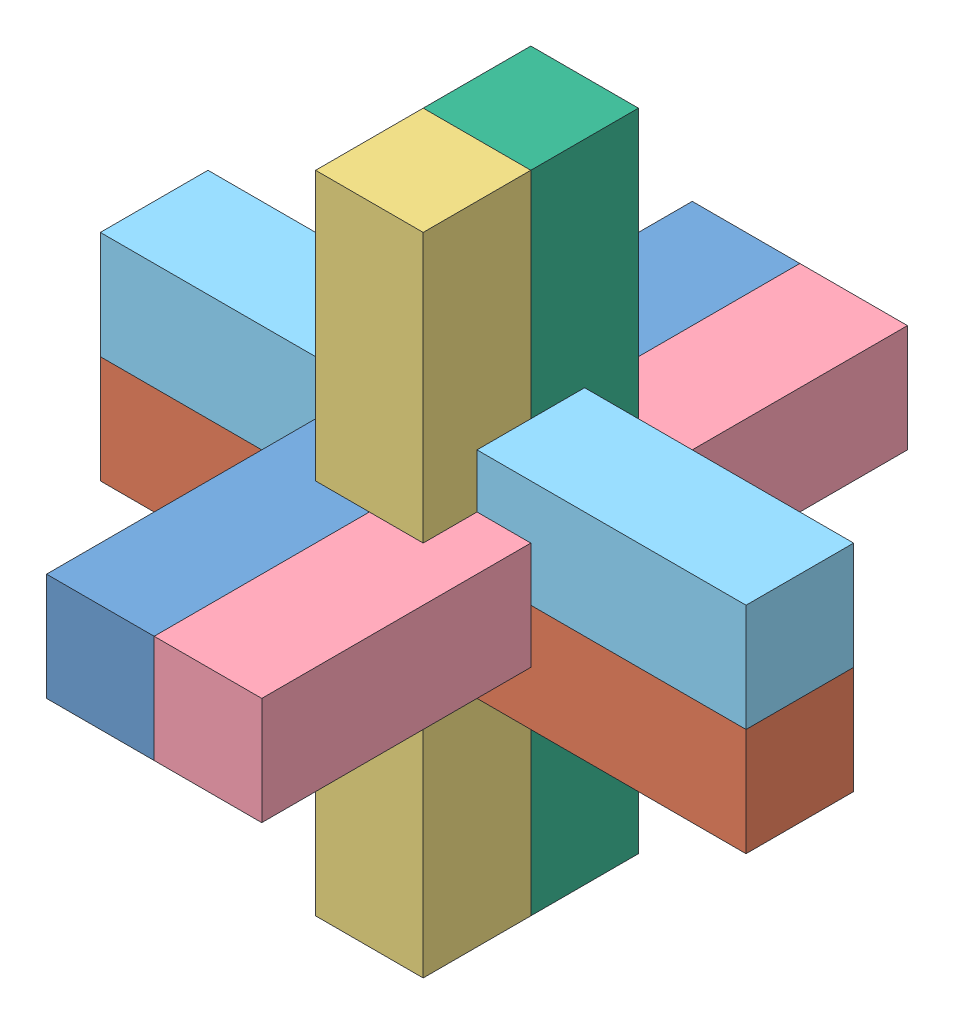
SolidWorks assembly Assem1.SLDASM, configuration Default (file format 4100). Lengths in mm.
Overall size (120 120 120).
6 component instances, 6 part files, 15 mates.
Components (placement in the parent):
- Part1-1: Part1.SLDPRT [Default] at (-20.904 -2.2608 -59.504) size (20 20 120)
- Part2-1: Part2.SLDPRT [Default] at (-60.904 7.7392 10.496) x (1 0 0) z (0 1 0) size (120 20 20)
- Part3-1: Part3.SLDPRT [Default] at (-10.904 -52.2608 20.496) x (0 1 0) z (-1 0 0) size (120 20 20)
- Part4-1: Part4.SLDPRT [Default] at (19.096 -2.2608 -59.504) x (0 0 1) z (0 -1 0) size (120 20 20)
- Part5-1: Part5.SLDPRT [Default] at (-60.904 27.7392 -9.504) x (1 0 0) z (0 0 -1) size (120 20 20)
- Part6-1: Part6.SLDPRT [Default] at (9.096 67.7392 -19.504) x (0 -1 0) z (0 0 -1) size (120 20 20)
Mates (geometry in assembly coordinates):
- Coincident1: coincident aligned: plane of Part1-1 through (-10.904 -2.2608 10.496) normal (1 0 0); plane of Part2-1 through (-10.904 -12.2608 -9.504) normal (1 0 0)
- Coincident2: coincident anti-aligned: plane of Part1-1 through (-0.904 -2.2608 10.496) normal (0 0 -1); plane of Part2-1 through (-60.904 -12.2608 10.496) normal (0 0 1)
- Coincident3: coincident anti-aligned: plane of Part1-1 through (-20.904 7.7392 10.496) normal (0 -1 0); plane of Part2-1 through (-60.904 7.7392 -9.504) normal (0 1 0)
- Coincident4: coincident anti-aligned: plane of Part1-1 through (-0.904 -2.2608 60.496) normal (1 0 0); plane of Part3-1 through (-0.904 -2.2608 20.496) normal (-1 0 0)
- Coincident5: coincident anti-aligned: plane of Part2-1 through (-60.904 -12.2608 10.496) normal (0 0 1); plane of Part3-1 through (9.096 -12.2608 10.496) normal (0 0 -1)
- Coincident6: coincident anti-aligned: plane of Part1-1 through (-20.904 -2.2608 60.496) normal (0 -1 0); plane of Part3-1 through (-10.904 -2.2608 20.496) normal (0 1 0)
- Coincident7: coincident anti-aligned: plane of Part2-1 through (9.096 -2.2608 10.496) normal (0 1 0); plane of Part4-1 through (-0.904 -2.2608 -59.504) normal (0 -1 0)
- Coincident8: coincident anti-aligned: plane of Part3-1 through (9.096 -52.2608 20.496) normal (0 0 1); plane of Part4-1 through (-0.904 17.7392 20.496) normal (0 0 -1)
- Coincident9: coincident anti-aligned: plane of Part1-1 through (-0.904 -2.2608 60.496) normal (1 0 0); plane of Part4-1 through (-0.904 17.7392 -59.504) normal (-1 0 0)
- Coincident10: coincident anti-aligned: plane of Part3-1 through (9.096 -12.2608 10.496) normal (0 0 -1); plane of Part5-1 through (-60.904 7.7392 10.496) normal (0 0 1)
- Coincident11: coincident anti-aligned: plane of Part3-1 through (9.096 27.7392 0.496) normal (0 -1 0); plane of Part5-1 through (-60.904 27.7392 10.496) normal (0 1 0)
- Coincident12: coincident anti-aligned: plane of Part1-1 through (-20.904 -2.2608 60.496) normal (-1 0 0); plane of Part5-1 through (-20.904 7.7392 10.496) normal (1 0 0)
- Coincident13: coincident anti-aligned: plane of Part6-1 through (-10.904 67.7392 0.496) normal (0 0 1); plane of Part3-1 through (9.096 -52.2608 0.496) normal (0 0 -1)
- Coincident14: coincident anti-aligned: plane of Part1-1 through (-10.904 -2.2608 10.496) normal (1 0 0); plane of Part6-1 through (-10.904 67.7392 0.496) normal (-1 0 0)
- Coincident15: coincident aligned: plane of Part3-1 through (-10.904 67.7392 0.496) normal (0 1 0); plane of Part6-1 through (-10.904 67.7392 -19.504) normal (0 1 0)
